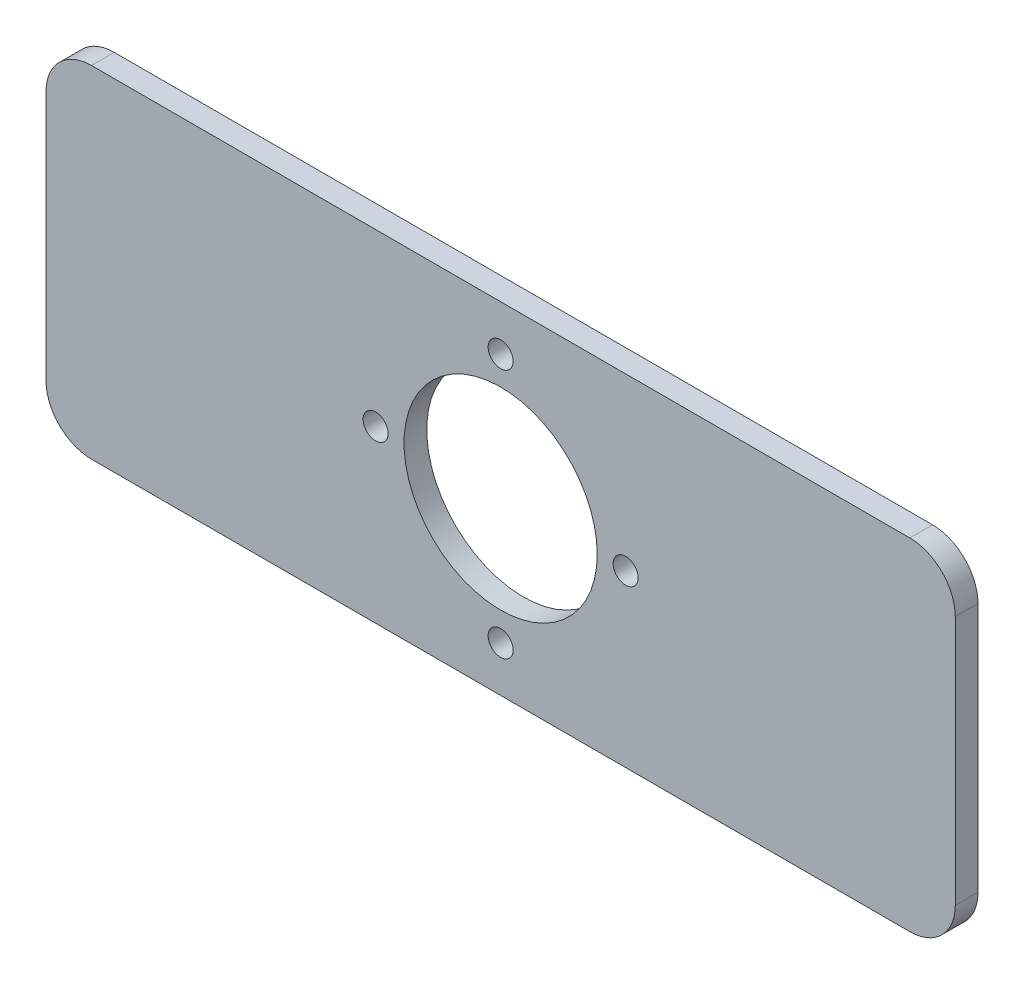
ISO-10303-21;
HEADER;
FILE_DESCRIPTION(('STEP AP214'),'2;1');
FILE_NAME('part.step','',(''),(''),'','','');
FILE_SCHEMA(('AUTOMOTIVE_DESIGN { 1 0 10303 214 1 1 1 1 }'));
ENDSEC;
DATA;
#1=APPLICATION_CONTEXT('core data for automotive mechanical design processes');
#2=APPLICATION_PROTOCOL_DEFINITION('international standard','automotive_design',2000,#1);
#3=PRODUCT_CONTEXT('',#1,'mechanical');
#4=PRODUCT('Part','Part','',(#3));
#5=PRODUCT_RELATED_PRODUCT_CATEGORY('part','',(#4));
#6=PRODUCT_DEFINITION_FORMATION('','',#4);
#7=PRODUCT_DEFINITION_CONTEXT('part definition',#1,'design');
#8=PRODUCT_DEFINITION('design','',#6,#7);
#9=PRODUCT_DEFINITION_SHAPE('','',#8);
#10=(LENGTH_UNIT() NAMED_UNIT(*) SI_UNIT(.MILLI.,.METRE.));
#11=(NAMED_UNIT(*) PLANE_ANGLE_UNIT() SI_UNIT($,.RADIAN.));
#12=(NAMED_UNIT(*) SI_UNIT($,.STERADIAN.) SOLID_ANGLE_UNIT());
#13=UNCERTAINTY_MEASURE_WITH_UNIT(LENGTH_MEASURE(1.E-05),#10,'distance_accuracy_value','');
#14=(GEOMETRIC_REPRESENTATION_CONTEXT(3) GLOBAL_UNCERTAINTY_ASSIGNED_CONTEXT((#13)) GLOBAL_UNIT_ASSIGNED_CONTEXT((#10,
#11,#12)) REPRESENTATION_CONTEXT('',''));
#15=CARTESIAN_POINT('',(0.,0.,0.));
#16=DIRECTION('',(0.,0.,1.));
#17=DIRECTION('',(1.,0.,0.));
#18=AXIS2_PLACEMENT_3D('',#15,#16,#17);
#19=CARTESIAN_POINT('',(380.,-20.,10.));
#20=DIRECTION('',(0.,0.,1.));
#21=DIRECTION('',(1.,0.,0.));
#22=AXIS2_PLACEMENT_3D('',#19,#20,#21);
#23=PLANE('',#22);
#24=CARTESIAN_POINT('',(200.,-130.,10.));
#25=DIRECTION('',(0.,0.,1.));
#26=DIRECTION('',(1.,0.,0.));
#27=AXIS2_PLACEMENT_3D('',#24,#25,#26);
#28=CIRCLE('',#27,5.50000000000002);
#29=CARTESIAN_POINT('',(205.5,-130.,10.));
#30=VERTEX_POINT('',#29);
#31=EDGE_CURVE('E235',#30,#30,#28,.T.);
#32=ORIENTED_EDGE('',*,*,#31,.F.);
#33=EDGE_LOOP('',(#32));
#34=FACE_BOUND('',#33,.T.);
#35=CARTESIAN_POINT('',(200.,-20.,10.));
#36=DIRECTION('',(0.,0.,1.));
#37=DIRECTION('',(1.,0.,0.));
#38=AXIS2_PLACEMENT_3D('',#35,#36,#37);
#39=CIRCLE('',#38,5.50000000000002);
#40=CARTESIAN_POINT('',(205.5,-20.,10.));
#41=VERTEX_POINT('',#40);
#42=EDGE_CURVE('E247',#41,#41,#39,.T.);
#43=ORIENTED_EDGE('',*,*,#42,.F.);
#44=EDGE_LOOP('',(#43));
#45=FACE_BOUND('',#44,.T.);
#46=CARTESIAN_POINT('',(380.,-20.,10.));
#47=DIRECTION('',(0.,0.,1.));
#48=DIRECTION('',(1.,0.,0.));
#49=AXIS2_PLACEMENT_3D('',#46,#47,#48);
#50=CIRCLE('',#49,20.);
#51=CARTESIAN_POINT('',(400.,-20.0000000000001,10.));
#52=VERTEX_POINT('',#51);
#53=CARTESIAN_POINT('',(380.,0.,10.));
#54=VERTEX_POINT('',#53);
#55=EDGE_CURVE('E131',#52,#54,#50,.T.);
#56=ORIENTED_EDGE('',*,*,#55,.T.);
#57=DIRECTION('',(-1.,0.,0.));
#58=VECTOR('',#57,1.);
#59=CARTESIAN_POINT('',(20.0000000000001,0.,10.));
#60=LINE('',#59,#58);
#61=CARTESIAN_POINT('',(20.0000000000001,0.,10.));
#62=VERTEX_POINT('',#61);
#63=EDGE_CURVE('E108',#54,#62,#60,.T.);
#64=ORIENTED_EDGE('',*,*,#63,.T.);
#65=CARTESIAN_POINT('',(20.,-20.,10.));
#66=DIRECTION('',(0.,0.,1.));
#67=DIRECTION('',(1.,0.,0.));
#68=AXIS2_PLACEMENT_3D('',#65,#66,#67);
#69=CIRCLE('',#68,20.);
#70=CARTESIAN_POINT('',(0.,-20.0000000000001,10.));
#71=VERTEX_POINT('',#70);
#72=EDGE_CURVE('E134',#62,#71,#69,.T.);
#73=ORIENTED_EDGE('',*,*,#72,.T.);
#74=DIRECTION('',(0.,-1.,0.));
#75=VECTOR('',#74,1.);
#76=CARTESIAN_POINT('',(0.,-20.0000000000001,10.));
#77=LINE('',#76,#75);
#78=CARTESIAN_POINT('',(0.,-130.,10.));
#79=VERTEX_POINT('',#78);
#80=EDGE_CURVE('E136',#71,#79,#77,.T.);
#81=ORIENTED_EDGE('',*,*,#80,.T.);
#82=CARTESIAN_POINT('',(20.,-130.,10.));
#83=DIRECTION('',(0.,0.,1.));
#84=DIRECTION('',(1.,0.,0.));
#85=AXIS2_PLACEMENT_3D('',#82,#83,#84);
#86=CIRCLE('',#85,20.);
#87=CARTESIAN_POINT('',(20.0000000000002,-150.,10.));
#88=VERTEX_POINT('',#87);
#89=EDGE_CURVE('E138',#79,#88,#86,.T.);
#90=ORIENTED_EDGE('',*,*,#89,.T.);
#91=DIRECTION('',(1.,0.,0.));
#92=VECTOR('',#91,1.);
#93=CARTESIAN_POINT('',(20.0000000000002,-150.,10.));
#94=LINE('',#93,#92);
#95=CARTESIAN_POINT('',(380.,-150.,10.));
#96=VERTEX_POINT('',#95);
#97=EDGE_CURVE('E140',#88,#96,#94,.T.);
#98=ORIENTED_EDGE('',*,*,#97,.T.);
#99=CARTESIAN_POINT('',(380.,-130.,10.));
#100=DIRECTION('',(0.,0.,1.));
#101=DIRECTION('',(1.,0.,0.));
#102=AXIS2_PLACEMENT_3D('',#99,#100,#101);
#103=CIRCLE('',#102,20.);
#104=CARTESIAN_POINT('',(400.,-130.,10.));
#105=VERTEX_POINT('',#104);
#106=EDGE_CURVE('E49',#96,#105,#103,.T.);
#107=ORIENTED_EDGE('',*,*,#106,.T.);
#108=DIRECTION('',(0.,1.,0.));
#109=VECTOR('',#108,1.);
#110=CARTESIAN_POINT('',(400.,-20.0000000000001,10.));
#111=LINE('',#110,#109);
#112=EDGE_CURVE('E44',#105,#52,#111,.T.);
#113=ORIENTED_EDGE('',*,*,#112,.T.);
#114=EDGE_LOOP('',(#56,#64,#73,#81,#90,#98,#107,#113));
#115=FACE_BOUND('',#114,.T.);
#116=CARTESIAN_POINT('',(200.,-75.,10.));
#117=DIRECTION('',(0.,0.,1.));
#118=DIRECTION('',(1.,0.,0.));
#119=AXIS2_PLACEMENT_3D('',#116,#117,#118);
#120=CIRCLE('',#119,42.5);
#121=CARTESIAN_POINT('',(242.5,-75.,10.));
#122=VERTEX_POINT('',#121);
#123=EDGE_CURVE('E113',#122,#122,#120,.T.);
#124=ORIENTED_EDGE('',*,*,#123,.F.);
#125=EDGE_LOOP('',(#124));
#126=FACE_BOUND('',#125,.T.);
#127=CARTESIAN_POINT('',(255.,-75.,10.));
#128=DIRECTION('',(0.,0.,1.));
#129=DIRECTION('',(1.,0.,0.));
#130=AXIS2_PLACEMENT_3D('',#127,#128,#129);
#131=CIRCLE('',#130,5.50000000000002);
#132=CARTESIAN_POINT('',(260.5,-75.,10.));
#133=VERTEX_POINT('',#132);
#134=EDGE_CURVE('E241',#133,#133,#131,.T.);
#135=ORIENTED_EDGE('',*,*,#134,.F.);
#136=EDGE_LOOP('',(#135));
#137=FACE_BOUND('',#136,.T.);
#138=CARTESIAN_POINT('',(145.,-75.,10.));
#139=DIRECTION('',(0.,0.,1.));
#140=DIRECTION('',(1.,0.,0.));
#141=AXIS2_PLACEMENT_3D('',#138,#139,#140);
#142=CIRCLE('',#141,5.50000000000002);
#143=CARTESIAN_POINT('',(150.5,-75.,10.));
#144=VERTEX_POINT('',#143);
#145=EDGE_CURVE('E224',#144,#144,#142,.T.);
#146=ORIENTED_EDGE('',*,*,#145,.F.);
#147=EDGE_LOOP('',(#146));
#148=FACE_BOUND('',#147,.T.);
#149=ADVANCED_FACE('F29',(#34,#45,#115,#126,#137,#148),#23,.T.);
#150=CARTESIAN_POINT('',(380.,-20.,0.));
#151=DIRECTION('',(0.,0.,1.));
#152=DIRECTION('',(1.,0.,0.));
#153=AXIS2_PLACEMENT_3D('',#150,#151,#152);
#154=PLANE('',#153);
#155=CARTESIAN_POINT('',(200.,-130.,0.));
#156=DIRECTION('',(0.,0.,1.));
#157=DIRECTION('',(1.,0.,0.));
#158=AXIS2_PLACEMENT_3D('',#155,#156,#157);
#159=CIRCLE('',#158,5.50000000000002);
#160=CARTESIAN_POINT('',(205.5,-130.,0.));
#161=VERTEX_POINT('',#160);
#162=EDGE_CURVE('E230',#161,#161,#159,.T.);
#163=ORIENTED_EDGE('',*,*,#162,.T.);
#164=EDGE_LOOP('',(#163));
#165=FACE_BOUND('',#164,.T.);
#166=CARTESIAN_POINT('',(200.,-20.,0.));
#167=DIRECTION('',(0.,0.,1.));
#168=DIRECTION('',(1.,0.,0.));
#169=AXIS2_PLACEMENT_3D('',#166,#167,#168);
#170=CIRCLE('',#169,5.50000000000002);
#171=CARTESIAN_POINT('',(205.5,-20.,0.));
#172=VERTEX_POINT('',#171);
#173=EDGE_CURVE('E244',#172,#172,#170,.T.);
#174=ORIENTED_EDGE('',*,*,#173,.T.);
#175=EDGE_LOOP('',(#174));
#176=FACE_BOUND('',#175,.T.);
#177=CARTESIAN_POINT('',(380.,-20.,0.));
#178=DIRECTION('',(0.,0.,1.));
#179=DIRECTION('',(1.,0.,0.));
#180=AXIS2_PLACEMENT_3D('',#177,#178,#179);
#181=CIRCLE('',#180,20.);
#182=CARTESIAN_POINT('',(400.,-20.0000000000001,0.));
#183=VERTEX_POINT('',#182);
#184=CARTESIAN_POINT('',(380.,0.,0.));
#185=VERTEX_POINT('',#184);
#186=EDGE_CURVE('E99',#183,#185,#181,.T.);
#187=ORIENTED_EDGE('',*,*,#186,.F.);
#188=DIRECTION('',(0.,1.,0.));
#189=VECTOR('',#188,1.);
#190=CARTESIAN_POINT('',(400.,-20.0000000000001,0.));
#191=LINE('',#190,#189);
#192=CARTESIAN_POINT('',(400.,-130.,0.));
#193=VERTEX_POINT('',#192);
#194=EDGE_CURVE('E129',#193,#183,#191,.T.);
#195=ORIENTED_EDGE('',*,*,#194,.F.);
#196=CARTESIAN_POINT('',(380.,-130.,0.));
#197=DIRECTION('',(0.,0.,1.));
#198=DIRECTION('',(1.,0.,0.));
#199=AXIS2_PLACEMENT_3D('',#196,#197,#198);
#200=CIRCLE('',#199,20.);
#201=CARTESIAN_POINT('',(380.,-150.,0.));
#202=VERTEX_POINT('',#201);
#203=EDGE_CURVE('E127',#202,#193,#200,.T.);
#204=ORIENTED_EDGE('',*,*,#203,.F.);
#205=DIRECTION('',(1.,0.,0.));
#206=VECTOR('',#205,1.);
#207=CARTESIAN_POINT('',(20.0000000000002,-150.,0.));
#208=LINE('',#207,#206);
#209=CARTESIAN_POINT('',(20.0000000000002,-150.,0.));
#210=VERTEX_POINT('',#209);
#211=EDGE_CURVE('E125',#210,#202,#208,.T.);
#212=ORIENTED_EDGE('',*,*,#211,.F.);
#213=CARTESIAN_POINT('',(20.,-130.,0.));
#214=DIRECTION('',(0.,0.,1.));
#215=DIRECTION('',(1.,0.,0.));
#216=AXIS2_PLACEMENT_3D('',#213,#214,#215);
#217=CIRCLE('',#216,20.);
#218=CARTESIAN_POINT('',(0.,-130.,0.));
#219=VERTEX_POINT('',#218);
#220=EDGE_CURVE('E123',#219,#210,#217,.T.);
#221=ORIENTED_EDGE('',*,*,#220,.F.);
#222=DIRECTION('',(0.,-1.,0.));
#223=VECTOR('',#222,1.);
#224=CARTESIAN_POINT('',(0.,-20.0000000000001,0.));
#225=LINE('',#224,#223);
#226=CARTESIAN_POINT('',(0.,-20.0000000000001,0.));
#227=VERTEX_POINT('',#226);
#228=EDGE_CURVE('E121',#227,#219,#225,.T.);
#229=ORIENTED_EDGE('',*,*,#228,.F.);
#230=CARTESIAN_POINT('',(20.,-20.,0.));
#231=DIRECTION('',(0.,0.,1.));
#232=DIRECTION('',(1.,0.,0.));
#233=AXIS2_PLACEMENT_3D('',#230,#231,#232);
#234=CIRCLE('',#233,20.);
#235=CARTESIAN_POINT('',(20.0000000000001,0.,0.));
#236=VERTEX_POINT('',#235);
#237=EDGE_CURVE('E101',#236,#227,#234,.T.);
#238=ORIENTED_EDGE('',*,*,#237,.F.);
#239=DIRECTION('',(-1.,0.,0.));
#240=VECTOR('',#239,1.);
#241=CARTESIAN_POINT('',(20.0000000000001,0.,0.));
#242=LINE('',#241,#240);
#243=EDGE_CURVE('E94',#185,#236,#242,.T.);
#244=ORIENTED_EDGE('',*,*,#243,.F.);
#245=EDGE_LOOP('',(#187,#195,#204,#212,#221,#229,#238,#244));
#246=FACE_BOUND('',#245,.T.);
#247=CARTESIAN_POINT('',(200.,-75.,0.));
#248=DIRECTION('',(0.,0.,1.));
#249=DIRECTION('',(1.,0.,0.));
#250=AXIS2_PLACEMENT_3D('',#247,#248,#249);
#251=CIRCLE('',#250,42.5);
#252=CARTESIAN_POINT('',(242.5,-75.,0.));
#253=VERTEX_POINT('',#252);
#254=EDGE_CURVE('E116',#253,#253,#251,.T.);
#255=ORIENTED_EDGE('',*,*,#254,.T.);
#256=EDGE_LOOP('',(#255));
#257=FACE_BOUND('',#256,.T.);
#258=CARTESIAN_POINT('',(255.,-75.,0.));
#259=DIRECTION('',(0.,0.,1.));
#260=DIRECTION('',(1.,0.,0.));
#261=AXIS2_PLACEMENT_3D('',#258,#259,#260);
#262=CIRCLE('',#261,5.50000000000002);
#263=CARTESIAN_POINT('',(260.5,-75.,0.));
#264=VERTEX_POINT('',#263);
#265=EDGE_CURVE('E238',#264,#264,#262,.T.);
#266=ORIENTED_EDGE('',*,*,#265,.T.);
#267=EDGE_LOOP('',(#266));
#268=FACE_BOUND('',#267,.T.);
#269=CARTESIAN_POINT('',(145.,-75.,0.));
#270=DIRECTION('',(0.,0.,1.));
#271=DIRECTION('',(1.,0.,0.));
#272=AXIS2_PLACEMENT_3D('',#269,#270,#271);
#273=CIRCLE('',#272,5.50000000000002);
#274=CARTESIAN_POINT('',(150.5,-75.,0.));
#275=VERTEX_POINT('',#274);
#276=EDGE_CURVE('E227',#275,#275,#273,.T.);
#277=ORIENTED_EDGE('',*,*,#276,.T.);
#278=EDGE_LOOP('',(#277));
#279=FACE_BOUND('',#278,.T.);
#280=ADVANCED_FACE('F95',(#165,#176,#246,#257,#268,#279),#154,.F.);
#281=CARTESIAN_POINT('',(380.,-20.,10.));
#282=DIRECTION('',(0.,0.,-1.));
#283=DIRECTION('',(-1.,0.,0.));
#284=AXIS2_PLACEMENT_3D('',#281,#282,#283);
#285=CYLINDRICAL_SURFACE('',#284,20.);
#286=ORIENTED_EDGE('',*,*,#186,.T.);
#287=DIRECTION('',(0.,0.,-1.));
#288=VECTOR('',#287,1.);
#289=CARTESIAN_POINT('',(380.,0.,10.));
#290=LINE('',#289,#288);
#291=EDGE_CURVE('E11',#54,#185,#290,.T.);
#292=ORIENTED_EDGE('',*,*,#291,.F.);
#293=ORIENTED_EDGE('',*,*,#55,.F.);
#294=DIRECTION('',(0.,0.,-1.));
#295=VECTOR('',#294,1.);
#296=CARTESIAN_POINT('',(400.,-20.0000000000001,10.));
#297=LINE('',#296,#295);
#298=EDGE_CURVE('E112',#52,#183,#297,.T.);
#299=ORIENTED_EDGE('',*,*,#298,.T.);
#300=EDGE_LOOP('',(#286,#292,#293,#299));
#301=FACE_BOUND('',#300,.T.);
#302=ADVANCED_FACE('F31',(#301),#285,.T.);
#303=CARTESIAN_POINT('',(20.0000000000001,0.,10.));
#304=DIRECTION('',(0.,-1.,0.));
#305=DIRECTION('',(0.,0.,-1.));
#306=AXIS2_PLACEMENT_3D('',#303,#304,#305);
#307=PLANE('',#306);
#308=ORIENTED_EDGE('',*,*,#243,.T.);
#309=DIRECTION('',(0.,0.,-1.));
#310=VECTOR('',#309,1.);
#311=CARTESIAN_POINT('',(20.0000000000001,0.,10.));
#312=LINE('',#311,#310);
#313=EDGE_CURVE('E37',#62,#236,#312,.T.);
#314=ORIENTED_EDGE('',*,*,#313,.F.);
#315=ORIENTED_EDGE('',*,*,#63,.F.);
#316=ORIENTED_EDGE('',*,*,#291,.T.);
#317=EDGE_LOOP('',(#308,#314,#315,#316));
#318=FACE_BOUND('',#317,.T.);
#319=ADVANCED_FACE('F107',(#318),#307,.F.);
#320=CARTESIAN_POINT('',(20.,-20.,10.));
#321=DIRECTION('',(0.,0.,-1.));
#322=DIRECTION('',(-1.,0.,0.));
#323=AXIS2_PLACEMENT_3D('',#320,#321,#322);
#324=CYLINDRICAL_SURFACE('',#323,20.);
#325=ORIENTED_EDGE('',*,*,#237,.T.);
#326=DIRECTION('',(0.,0.,-1.));
#327=VECTOR('',#326,1.);
#328=CARTESIAN_POINT('',(0.,-20.0000000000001,10.));
#329=LINE('',#328,#327);
#330=EDGE_CURVE('E157',#71,#227,#329,.T.);
#331=ORIENTED_EDGE('',*,*,#330,.F.);
#332=ORIENTED_EDGE('',*,*,#72,.F.);
#333=ORIENTED_EDGE('',*,*,#313,.T.);
#334=EDGE_LOOP('',(#325,#331,#332,#333));
#335=FACE_BOUND('',#334,.T.);
#336=ADVANCED_FACE('F161',(#335),#324,.T.);
#337=CARTESIAN_POINT('',(0.,-20.0000000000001,10.));
#338=DIRECTION('',(1.,0.,0.));
#339=DIRECTION('',(0.,1.,0.));
#340=AXIS2_PLACEMENT_3D('',#337,#338,#339);
#341=PLANE('',#340);
#342=ORIENTED_EDGE('',*,*,#228,.T.);
#343=DIRECTION('',(0.,0.,-1.));
#344=VECTOR('',#343,1.);
#345=CARTESIAN_POINT('',(0.,-130.,10.));
#346=LINE('',#345,#344);
#347=EDGE_CURVE('E154',#79,#219,#346,.T.);
#348=ORIENTED_EDGE('',*,*,#347,.F.);
#349=ORIENTED_EDGE('',*,*,#80,.F.);
#350=ORIENTED_EDGE('',*,*,#330,.T.);
#351=EDGE_LOOP('',(#342,#348,#349,#350));
#352=FACE_BOUND('',#351,.T.);
#353=ADVANCED_FACE('F169',(#352),#341,.F.);
#354=CARTESIAN_POINT('',(20.,-130.,10.));
#355=DIRECTION('',(0.,0.,-1.));
#356=DIRECTION('',(-1.,0.,0.));
#357=AXIS2_PLACEMENT_3D('',#354,#355,#356);
#358=CYLINDRICAL_SURFACE('',#357,20.);
#359=ORIENTED_EDGE('',*,*,#220,.T.);
#360=DIRECTION('',(0.,0.,-1.));
#361=VECTOR('',#360,1.);
#362=CARTESIAN_POINT('',(20.0000000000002,-150.,10.));
#363=LINE('',#362,#361);
#364=EDGE_CURVE('E151',#88,#210,#363,.T.);
#365=ORIENTED_EDGE('',*,*,#364,.F.);
#366=ORIENTED_EDGE('',*,*,#89,.F.);
#367=ORIENTED_EDGE('',*,*,#347,.T.);
#368=EDGE_LOOP('',(#359,#365,#366,#367));
#369=FACE_BOUND('',#368,.T.);
#370=ADVANCED_FACE('F172',(#369),#358,.T.);
#371=CARTESIAN_POINT('',(20.0000000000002,-150.,10.));
#372=DIRECTION('',(0.,1.,0.));
#373=DIRECTION('',(0.,0.,1.));
#374=AXIS2_PLACEMENT_3D('',#371,#372,#373);
#375=PLANE('',#374);
#376=ORIENTED_EDGE('',*,*,#211,.T.);
#377=DIRECTION('',(0.,0.,-1.));
#378=VECTOR('',#377,1.);
#379=CARTESIAN_POINT('',(380.,-150.,10.));
#380=LINE('',#379,#378);
#381=EDGE_CURVE('E148',#96,#202,#380,.T.);
#382=ORIENTED_EDGE('',*,*,#381,.F.);
#383=ORIENTED_EDGE('',*,*,#97,.F.);
#384=ORIENTED_EDGE('',*,*,#364,.T.);
#385=EDGE_LOOP('',(#376,#382,#383,#384));
#386=FACE_BOUND('',#385,.T.);
#387=ADVANCED_FACE('F177',(#386),#375,.F.);
#388=CARTESIAN_POINT('',(380.,-130.,10.));
#389=DIRECTION('',(0.,0.,-1.));
#390=DIRECTION('',(-1.,0.,0.));
#391=AXIS2_PLACEMENT_3D('',#388,#389,#390);
#392=CYLINDRICAL_SURFACE('',#391,20.);
#393=ORIENTED_EDGE('',*,*,#203,.T.);
#394=DIRECTION('',(0.,0.,-1.));
#395=VECTOR('',#394,1.);
#396=CARTESIAN_POINT('',(400.,-130.,10.));
#397=LINE('',#396,#395);
#398=EDGE_CURVE('E145',#105,#193,#397,.T.);
#399=ORIENTED_EDGE('',*,*,#398,.F.);
#400=ORIENTED_EDGE('',*,*,#106,.F.);
#401=ORIENTED_EDGE('',*,*,#381,.T.);
#402=EDGE_LOOP('',(#393,#399,#400,#401));
#403=FACE_BOUND('',#402,.T.);
#404=ADVANCED_FACE('F180',(#403),#392,.T.);
#405=CARTESIAN_POINT('',(400.,-20.0000000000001,10.));
#406=DIRECTION('',(-1.,0.,0.));
#407=DIRECTION('',(0.,0.,1.));
#408=AXIS2_PLACEMENT_3D('',#405,#406,#407);
#409=PLANE('',#408);
#410=ORIENTED_EDGE('',*,*,#194,.T.);
#411=ORIENTED_EDGE('',*,*,#298,.F.);
#412=ORIENTED_EDGE('',*,*,#112,.F.);
#413=ORIENTED_EDGE('',*,*,#398,.T.);
#414=EDGE_LOOP('',(#410,#411,#412,#413));
#415=FACE_BOUND('',#414,.T.);
#416=ADVANCED_FACE('F182',(#415),#409,.F.);
#417=CARTESIAN_POINT('',(200.,-75.,10.));
#418=DIRECTION('',(0.,0.,-1.));
#419=DIRECTION('',(-1.,0.,0.));
#420=AXIS2_PLACEMENT_3D('',#417,#418,#419);
#421=CYLINDRICAL_SURFACE('',#420,42.5);
#422=ORIENTED_EDGE('',*,*,#123,.T.);
#423=EDGE_LOOP('',(#422));
#424=FACE_BOUND('',#423,.T.);
#425=ORIENTED_EDGE('',*,*,#254,.F.);
#426=EDGE_LOOP('',(#425));
#427=FACE_BOUND('',#426,.T.);
#428=ADVANCED_FACE('F184',(#424,#427),#421,.F.);
#429=CARTESIAN_POINT('',(200.,-20.,10.));
#430=DIRECTION('',(0.,0.,-1.));
#431=DIRECTION('',(-1.,0.,0.));
#432=AXIS2_PLACEMENT_3D('',#429,#430,#431);
#433=CYLINDRICAL_SURFACE('',#432,5.50000000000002);
#434=ORIENTED_EDGE('',*,*,#42,.T.);
#435=EDGE_LOOP('',(#434));
#436=FACE_BOUND('',#435,.T.);
#437=ORIENTED_EDGE('',*,*,#173,.F.);
#438=EDGE_LOOP('',(#437));
#439=FACE_BOUND('',#438,.T.);
#440=ADVANCED_FACE('F190',(#436,#439),#433,.F.);
#441=CARTESIAN_POINT('',(255.,-75.,10.));
#442=DIRECTION('',(0.,0.,-1.));
#443=DIRECTION('',(-1.,0.,0.));
#444=AXIS2_PLACEMENT_3D('',#441,#442,#443);
#445=CYLINDRICAL_SURFACE('',#444,5.50000000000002);
#446=ORIENTED_EDGE('',*,*,#134,.T.);
#447=EDGE_LOOP('',(#446));
#448=FACE_BOUND('',#447,.T.);
#449=ORIENTED_EDGE('',*,*,#265,.F.);
#450=EDGE_LOOP('',(#449));
#451=FACE_BOUND('',#450,.T.);
#452=ADVANCED_FACE('F207',(#448,#451),#445,.F.);
#453=CARTESIAN_POINT('',(200.,-130.,10.));
#454=DIRECTION('',(0.,0.,-1.));
#455=DIRECTION('',(-1.,0.,0.));
#456=AXIS2_PLACEMENT_3D('',#453,#454,#455);
#457=CYLINDRICAL_SURFACE('',#456,5.50000000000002);
#458=ORIENTED_EDGE('',*,*,#31,.T.);
#459=EDGE_LOOP('',(#458));
#460=FACE_BOUND('',#459,.T.);
#461=ORIENTED_EDGE('',*,*,#162,.F.);
#462=EDGE_LOOP('',(#461));
#463=FACE_BOUND('',#462,.T.);
#464=ADVANCED_FACE('F211',(#460,#463),#457,.F.);
#465=CARTESIAN_POINT('',(145.,-75.,10.));
#466=DIRECTION('',(0.,0.,-1.));
#467=DIRECTION('',(-1.,0.,0.));
#468=AXIS2_PLACEMENT_3D('',#465,#466,#467);
#469=CYLINDRICAL_SURFACE('',#468,5.50000000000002);
#470=ORIENTED_EDGE('',*,*,#145,.T.);
#471=EDGE_LOOP('',(#470));
#472=FACE_BOUND('',#471,.T.);
#473=ORIENTED_EDGE('',*,*,#276,.F.);
#474=EDGE_LOOP('',(#473));
#475=FACE_BOUND('',#474,.T.);
#476=ADVANCED_FACE('F215',(#472,#475),#469,.F.);
#477=CLOSED_SHELL('',(#149,#280,#302,#319,#336,#353,#370,#387,#404,#416,#428,#440,#452,#464,#476));
#478=MANIFOLD_SOLID_BREP('B2',#477);
#479=ADVANCED_BREP_SHAPE_REPRESENTATION('',(#18,#478),#14);
#480=SHAPE_DEFINITION_REPRESENTATION(#9,#479);
ENDSEC;
END-ISO-10303-21;
